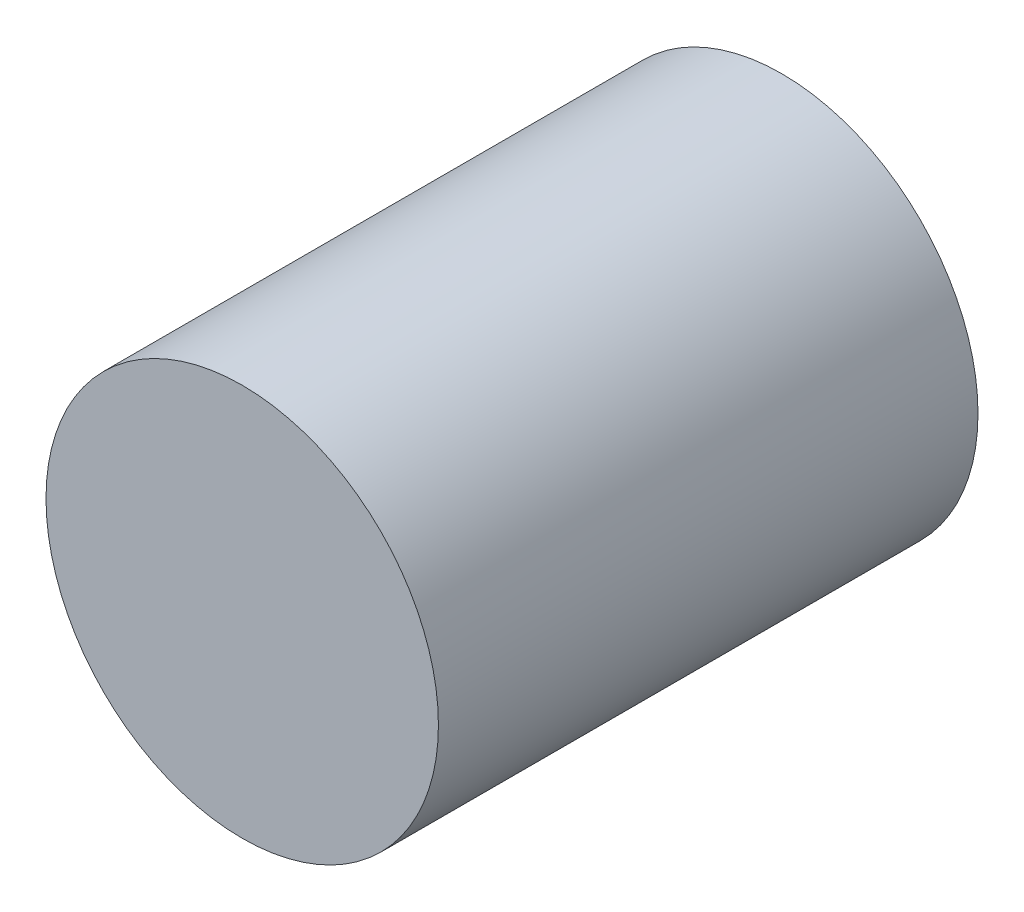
from build123d import *

# Parameters (mm, degrees)
IZIM1_R                     = 4
Y_KSEKLIK_EKSTR_ZYON1_DEPTH = 11


with BuildPart() as part:
    # izim1 → Y_kseklik-Ekstr_zyon1 (new body)
    with BuildSketch(Plane.XY):
        Circle(IZIM1_R)
    extrude(amount=Y_KSEKLIK_EKSTR_ZYON1_DEPTH)


solid = part.part
